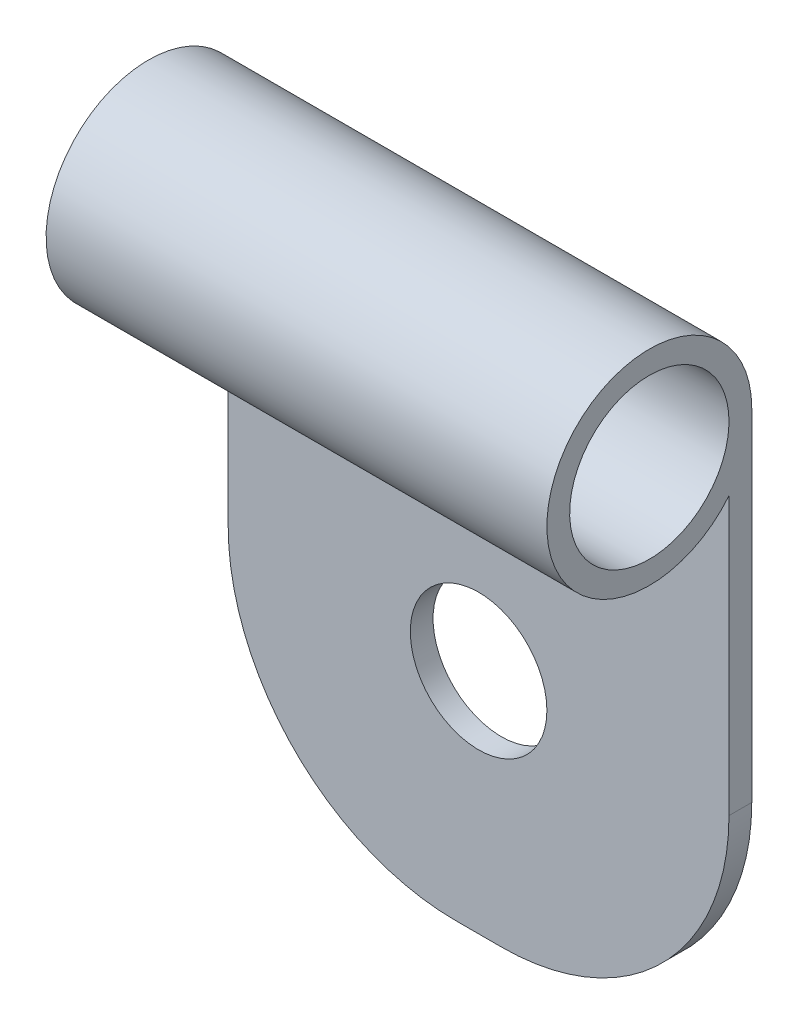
ISO-10303-21;
HEADER;
FILE_DESCRIPTION(('STEP AP214'),'2;1');
FILE_NAME('part.step','',(''),(''),'','','');
FILE_SCHEMA(('AUTOMOTIVE_DESIGN { 1 0 10303 214 1 1 1 1 }'));
ENDSEC;
DATA;
#1=APPLICATION_CONTEXT('core data for automotive mechanical design processes');
#2=APPLICATION_PROTOCOL_DEFINITION('international standard','automotive_design',2000,#1);
#3=PRODUCT_CONTEXT('',#1,'mechanical');
#4=PRODUCT('Part','Part','',(#3));
#5=PRODUCT_RELATED_PRODUCT_CATEGORY('part','',(#4));
#6=PRODUCT_DEFINITION_FORMATION('','',#4);
#7=PRODUCT_DEFINITION_CONTEXT('part definition',#1,'design');
#8=PRODUCT_DEFINITION('design','',#6,#7);
#9=PRODUCT_DEFINITION_SHAPE('','',#8);
#10=(LENGTH_UNIT() NAMED_UNIT(*) SI_UNIT(.MILLI.,.METRE.));
#11=(NAMED_UNIT(*) PLANE_ANGLE_UNIT() SI_UNIT($,.RADIAN.));
#12=(NAMED_UNIT(*) SI_UNIT($,.STERADIAN.) SOLID_ANGLE_UNIT());
#13=UNCERTAINTY_MEASURE_WITH_UNIT(LENGTH_MEASURE(1.E-05),#10,'distance_accuracy_value','');
#14=(GEOMETRIC_REPRESENTATION_CONTEXT(3) GLOBAL_UNCERTAINTY_ASSIGNED_CONTEXT((#13)) GLOBAL_UNIT_ASSIGNED_CONTEXT((#10,
#11,#12)) REPRESENTATION_CONTEXT('',''));
#15=CARTESIAN_POINT('',(0.,0.,0.));
#16=DIRECTION('',(0.,0.,1.));
#17=DIRECTION('',(1.,0.,0.));
#18=AXIS2_PLACEMENT_3D('',#15,#16,#17);
#19=CARTESIAN_POINT('',(-1.,0.,1.));
#20=DIRECTION('',(0.,0.,-1.));
#21=DIRECTION('',(-1.,0.,0.));
#22=AXIS2_PLACEMENT_3D('',#19,#20,#21);
#23=PLANE('',#22);
#24=DIRECTION('',(0.,1.,0.));
#25=VECTOR('',#24,1.);
#26=CARTESIAN_POINT('',(11.,15.,1.));
#27=LINE('',#26,#25);
#28=CARTESIAN_POINT('',(11.,0.,1.));
#29=VERTEX_POINT('',#28);
#30=CARTESIAN_POINT('',(11.,12.1715728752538,1.));
#31=VERTEX_POINT('',#30);
#32=EDGE_CURVE('E52',#29,#31,#27,.T.);
#33=ORIENTED_EDGE('',*,*,#32,.T.);
#34=DIRECTION('',(1.,0.,0.));
#35=VECTOR('',#34,1.);
#36=CARTESIAN_POINT('',(-11.,12.1715728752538,1.));
#37=LINE('',#36,#35);
#38=CARTESIAN_POINT('',(-11.,12.1715728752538,1.));
#39=VERTEX_POINT('',#38);
#40=EDGE_CURVE('E47',#31,#39,#37,.F.);
#41=ORIENTED_EDGE('',*,*,#40,.T.);
#42=DIRECTION('',(0.,-1.,0.));
#43=VECTOR('',#42,1.);
#44=CARTESIAN_POINT('',(-11.,15.,1.));
#45=LINE('',#44,#43);
#46=CARTESIAN_POINT('',(-11.,0.,1.));
#47=VERTEX_POINT('',#46);
#48=EDGE_CURVE('E104',#39,#47,#45,.T.);
#49=ORIENTED_EDGE('',*,*,#48,.T.);
#50=CARTESIAN_POINT('',(-1.,0.,1.));
#51=DIRECTION('',(0.,0.,1.));
#52=DIRECTION('',(-1.,0.,0.));
#53=AXIS2_PLACEMENT_3D('',#50,#51,#52);
#54=CIRCLE('',#53,10.);
#55=CARTESIAN_POINT('',(-1.,-10.,1.));
#56=VERTEX_POINT('',#55);
#57=EDGE_CURVE('E124',#47,#56,#54,.T.);
#58=ORIENTED_EDGE('',*,*,#57,.T.);
#59=DIRECTION('',(1.,0.,0.));
#60=VECTOR('',#59,1.);
#61=CARTESIAN_POINT('',(-1.,-10.,1.));
#62=LINE('',#61,#60);
#63=CARTESIAN_POINT('',(1.,-10.,1.));
#64=VERTEX_POINT('',#63);
#65=EDGE_CURVE('E126',#56,#64,#62,.T.);
#66=ORIENTED_EDGE('',*,*,#65,.T.);
#67=CARTESIAN_POINT('',(1.,0.,1.));
#68=DIRECTION('',(0.,0.,1.));
#69=DIRECTION('',(1.,0.,0.));
#70=AXIS2_PLACEMENT_3D('',#67,#68,#69);
#71=CIRCLE('',#70,10.);
#72=EDGE_CURVE('E128',#64,#29,#71,.T.);
#73=ORIENTED_EDGE('',*,*,#72,.T.);
#74=EDGE_LOOP('',(#33,#41,#49,#58,#66,#73));
#75=FACE_BOUND('',#74,.T.);
#76=CARTESIAN_POINT('',(0.,0.,1.));
#77=DIRECTION('',(0.,0.,1.));
#78=DIRECTION('',(1.,0.,0.));
#79=AXIS2_PLACEMENT_3D('',#76,#77,#78);
#80=CIRCLE('',#79,3.);
#81=CARTESIAN_POINT('',(3.,0.,1.));
#82=VERTEX_POINT('',#81);
#83=EDGE_CURVE('E95',#82,#82,#80,.T.);
#84=ORIENTED_EDGE('',*,*,#83,.F.);
#85=EDGE_LOOP('',(#84));
#86=FACE_BOUND('',#85,.T.);
#87=ADVANCED_FACE('F32',(#75,#86),#23,.F.);
#88=CARTESIAN_POINT('',(-1.,0.,0.));
#89=DIRECTION('',(0.,0.,-1.));
#90=DIRECTION('',(-1.,0.,0.));
#91=AXIS2_PLACEMENT_3D('',#88,#89,#90);
#92=PLANE('',#91);
#93=DIRECTION('',(-1.,0.,0.));
#94=VECTOR('',#93,1.);
#95=CARTESIAN_POINT('',(11.,15.,0.));
#96=LINE('',#95,#94);
#97=CARTESIAN_POINT('',(11.,15.,0.));
#98=VERTEX_POINT('',#97);
#99=CARTESIAN_POINT('',(-11.,15.,0.));
#100=VERTEX_POINT('',#99);
#101=EDGE_CURVE('E83',#98,#100,#96,.T.);
#102=ORIENTED_EDGE('',*,*,#101,.F.);
#103=DIRECTION('',(0.,1.,0.));
#104=VECTOR('',#103,1.);
#105=CARTESIAN_POINT('',(11.,15.,0.));
#106=LINE('',#105,#104);
#107=CARTESIAN_POINT('',(11.,0.,0.));
#108=VERTEX_POINT('',#107);
#109=EDGE_CURVE('E88',#108,#98,#106,.T.);
#110=ORIENTED_EDGE('',*,*,#109,.F.);
#111=CARTESIAN_POINT('',(1.,0.,0.));
#112=DIRECTION('',(0.,0.,1.));
#113=DIRECTION('',(1.,0.,0.));
#114=AXIS2_PLACEMENT_3D('',#111,#112,#113);
#115=CIRCLE('',#114,10.);
#116=CARTESIAN_POINT('',(1.,-10.,0.));
#117=VERTEX_POINT('',#116);
#118=EDGE_CURVE('E105',#117,#108,#115,.T.);
#119=ORIENTED_EDGE('',*,*,#118,.F.);
#120=DIRECTION('',(1.,0.,0.));
#121=VECTOR('',#120,1.);
#122=CARTESIAN_POINT('',(-1.,-10.,0.));
#123=LINE('',#122,#121);
#124=CARTESIAN_POINT('',(-1.,-10.,0.));
#125=VERTEX_POINT('',#124);
#126=EDGE_CURVE('E134',#125,#117,#123,.T.);
#127=ORIENTED_EDGE('',*,*,#126,.F.);
#128=CARTESIAN_POINT('',(-1.,0.,0.));
#129=DIRECTION('',(0.,0.,1.));
#130=DIRECTION('',(-1.,0.,0.));
#131=AXIS2_PLACEMENT_3D('',#128,#129,#130);
#132=CIRCLE('',#131,10.);
#133=CARTESIAN_POINT('',(-11.,0.,0.));
#134=VERTEX_POINT('',#133);
#135=EDGE_CURVE('E132',#134,#125,#132,.T.);
#136=ORIENTED_EDGE('',*,*,#135,.F.);
#137=DIRECTION('',(0.,-1.,0.));
#138=VECTOR('',#137,1.);
#139=CARTESIAN_POINT('',(-11.,15.,0.));
#140=LINE('',#139,#138);
#141=EDGE_CURVE('E90',#100,#134,#140,.T.);
#142=ORIENTED_EDGE('',*,*,#141,.F.);
#143=EDGE_LOOP('',(#102,#110,#119,#127,#136,#142));
#144=FACE_BOUND('',#143,.T.);
#145=CARTESIAN_POINT('',(0.,0.,0.));
#146=DIRECTION('',(0.,0.,1.));
#147=DIRECTION('',(1.,0.,0.));
#148=AXIS2_PLACEMENT_3D('',#145,#146,#147);
#149=CIRCLE('',#148,3.);
#150=CARTESIAN_POINT('',(3.,0.,0.));
#151=VERTEX_POINT('',#150);
#152=EDGE_CURVE('E118',#151,#151,#149,.T.);
#153=ORIENTED_EDGE('',*,*,#152,.T.);
#154=EDGE_LOOP('',(#153));
#155=FACE_BOUND('',#154,.T.);
#156=ADVANCED_FACE('F85',(#144,#155),#92,.T.);
#157=CARTESIAN_POINT('',(-11.,15.,1.));
#158=DIRECTION('',(1.,0.,0.));
#159=DIRECTION('',(0.,1.,0.));
#160=AXIS2_PLACEMENT_3D('',#157,#158,#159);
#161=PLANE('',#160);
#162=ORIENTED_EDGE('',*,*,#48,.F.);
#163=CARTESIAN_POINT('',(-11.,15.,4.5));
#164=DIRECTION('',(1.,0.,0.));
#165=DIRECTION('',(0.,1.,0.));
#166=AXIS2_PLACEMENT_3D('',#163,#164,#165);
#167=CIRCLE('',#166,4.5);
#168=EDGE_CURVE('E108',#100,#39,#167,.T.);
#169=ORIENTED_EDGE('',*,*,#168,.F.);
#170=ORIENTED_EDGE('',*,*,#141,.T.);
#171=DIRECTION('',(0.,0.,-1.));
#172=VECTOR('',#171,1.);
#173=CARTESIAN_POINT('',(-11.,0.,1.));
#174=LINE('',#173,#172);
#175=EDGE_CURVE('E11',#47,#134,#174,.T.);
#176=ORIENTED_EDGE('',*,*,#175,.F.);
#177=EDGE_LOOP('',(#162,#169,#170,#176));
#178=FACE_BOUND('',#177,.T.);
#179=CARTESIAN_POINT('',(-11.,15.,4.5));
#180=DIRECTION('',(1.,0.,0.));
#181=DIRECTION('',(0.,1.,0.));
#182=AXIS2_PLACEMENT_3D('',#179,#180,#181);
#183=CIRCLE('',#182,3.5);
#184=CARTESIAN_POINT('',(-11.,18.5,4.5));
#185=VERTEX_POINT('',#184);
#186=EDGE_CURVE('E109',#185,#185,#183,.T.);
#187=ORIENTED_EDGE('',*,*,#186,.T.);
#188=EDGE_LOOP('',(#187));
#189=FACE_BOUND('',#188,.T.);
#190=ADVANCED_FACE('F34',(#178,#189),#161,.F.);
#191=CARTESIAN_POINT('',(-1.,0.,1.));
#192=DIRECTION('',(0.,0.,-1.));
#193=DIRECTION('',(-1.,0.,0.));
#194=AXIS2_PLACEMENT_3D('',#191,#192,#193);
#195=CYLINDRICAL_SURFACE('',#194,10.);
#196=ORIENTED_EDGE('',*,*,#135,.T.);
#197=DIRECTION('',(0.,0.,-1.));
#198=VECTOR('',#197,1.);
#199=CARTESIAN_POINT('',(-1.,-10.,1.));
#200=LINE('',#199,#198);
#201=EDGE_CURVE('E40',#56,#125,#200,.T.);
#202=ORIENTED_EDGE('',*,*,#201,.F.);
#203=ORIENTED_EDGE('',*,*,#57,.F.);
#204=ORIENTED_EDGE('',*,*,#175,.T.);
#205=EDGE_LOOP('',(#196,#202,#203,#204));
#206=FACE_BOUND('',#205,.T.);
#207=ADVANCED_FACE('F154',(#206),#195,.T.);
#208=CARTESIAN_POINT('',(-1.,-10.,1.));
#209=DIRECTION('',(0.,1.,0.));
#210=DIRECTION('',(0.,0.,1.));
#211=AXIS2_PLACEMENT_3D('',#208,#209,#210);
#212=PLANE('',#211);
#213=ORIENTED_EDGE('',*,*,#126,.T.);
#214=DIRECTION('',(0.,0.,-1.));
#215=VECTOR('',#214,1.);
#216=CARTESIAN_POINT('',(1.,-10.,1.));
#217=LINE('',#216,#215);
#218=EDGE_CURVE('E138',#64,#117,#217,.T.);
#219=ORIENTED_EDGE('',*,*,#218,.F.);
#220=ORIENTED_EDGE('',*,*,#65,.F.);
#221=ORIENTED_EDGE('',*,*,#201,.T.);
#222=EDGE_LOOP('',(#213,#219,#220,#221));
#223=FACE_BOUND('',#222,.T.);
#224=ADVANCED_FACE('F145',(#223),#212,.F.);
#225=CARTESIAN_POINT('',(1.,0.,1.));
#226=DIRECTION('',(0.,0.,-1.));
#227=DIRECTION('',(-1.,0.,0.));
#228=AXIS2_PLACEMENT_3D('',#225,#226,#227);
#229=CYLINDRICAL_SURFACE('',#228,10.);
#230=ORIENTED_EDGE('',*,*,#118,.T.);
#231=DIRECTION('',(0.,0.,-1.));
#232=VECTOR('',#231,1.);
#233=CARTESIAN_POINT('',(11.,0.,1.));
#234=LINE('',#233,#232);
#235=EDGE_CURVE('E103',#29,#108,#234,.T.);
#236=ORIENTED_EDGE('',*,*,#235,.F.);
#237=ORIENTED_EDGE('',*,*,#72,.F.);
#238=ORIENTED_EDGE('',*,*,#218,.T.);
#239=EDGE_LOOP('',(#230,#236,#237,#238));
#240=FACE_BOUND('',#239,.T.);
#241=ADVANCED_FACE('F150',(#240),#229,.T.);
#242=CARTESIAN_POINT('',(11.,15.,1.));
#243=DIRECTION('',(-1.,0.,0.));
#244=DIRECTION('',(0.,-1.,0.));
#245=AXIS2_PLACEMENT_3D('',#242,#243,#244);
#246=PLANE('',#245);
#247=CARTESIAN_POINT('',(11.,15.,4.5));
#248=DIRECTION('',(1.,0.,0.));
#249=DIRECTION('',(0.,1.,0.));
#250=AXIS2_PLACEMENT_3D('',#247,#248,#249);
#251=CIRCLE('',#250,3.5);
#252=CARTESIAN_POINT('',(11.,18.5,4.5));
#253=VERTEX_POINT('',#252);
#254=EDGE_CURVE('E113',#253,#253,#251,.T.);
#255=ORIENTED_EDGE('',*,*,#254,.F.);
#256=EDGE_LOOP('',(#255));
#257=FACE_BOUND('',#256,.T.);
#258=ORIENTED_EDGE('',*,*,#109,.T.);
#259=CARTESIAN_POINT('',(11.,15.,4.5));
#260=DIRECTION('',(1.,0.,0.));
#261=DIRECTION('',(0.,1.,0.));
#262=AXIS2_PLACEMENT_3D('',#259,#260,#261);
#263=CIRCLE('',#262,4.5);
#264=EDGE_CURVE('E101',#98,#31,#263,.T.);
#265=ORIENTED_EDGE('',*,*,#264,.T.);
#266=ORIENTED_EDGE('',*,*,#32,.F.);
#267=ORIENTED_EDGE('',*,*,#235,.T.);
#268=EDGE_LOOP('',(#258,#265,#266,#267));
#269=FACE_BOUND('',#268,.T.);
#270=ADVANCED_FACE('F100',(#257,#269),#246,.F.);
#271=CARTESIAN_POINT('',(0.,0.,1.));
#272=DIRECTION('',(0.,0.,-1.));
#273=DIRECTION('',(-1.,0.,0.));
#274=AXIS2_PLACEMENT_3D('',#271,#272,#273);
#275=CYLINDRICAL_SURFACE('',#274,3.);
#276=ORIENTED_EDGE('',*,*,#83,.T.);
#277=EDGE_LOOP('',(#276));
#278=FACE_BOUND('',#277,.T.);
#279=ORIENTED_EDGE('',*,*,#152,.F.);
#280=EDGE_LOOP('',(#279));
#281=FACE_BOUND('',#280,.T.);
#282=ADVANCED_FACE('F167',(#278,#281),#275,.F.);
#283=CARTESIAN_POINT('',(-11.,15.,4.5));
#284=DIRECTION('',(1.,0.,0.));
#285=DIRECTION('',(0.,1.,0.));
#286=AXIS2_PLACEMENT_3D('',#283,#284,#285);
#287=CYLINDRICAL_SURFACE('',#286,4.5);
#288=ORIENTED_EDGE('',*,*,#40,.F.);
#289=ORIENTED_EDGE('',*,*,#264,.F.);
#290=ORIENTED_EDGE('',*,*,#101,.T.);
#291=ORIENTED_EDGE('',*,*,#168,.T.);
#292=EDGE_LOOP('',(#288,#289,#290,#291));
#293=FACE_BOUND('',#292,.T.);
#294=ADVANCED_FACE('F107',(#293),#287,.T.);
#295=CARTESIAN_POINT('',(-11.,15.,4.5));
#296=DIRECTION('',(1.,0.,0.));
#297=DIRECTION('',(0.,1.,0.));
#298=AXIS2_PLACEMENT_3D('',#295,#296,#297);
#299=CYLINDRICAL_SURFACE('',#298,3.5);
#300=ORIENTED_EDGE('',*,*,#254,.T.);
#301=EDGE_LOOP('',(#300));
#302=FACE_BOUND('',#301,.T.);
#303=ORIENTED_EDGE('',*,*,#186,.F.);
#304=EDGE_LOOP('',(#303));
#305=FACE_BOUND('',#304,.T.);
#306=ADVANCED_FACE('F160',(#302,#305),#299,.F.);
#307=CLOSED_SHELL('',(#87,#156,#190,#207,#224,#241,#270,#282,#294,#306));
#308=MANIFOLD_SOLID_BREP('B2',#307);
#309=ADVANCED_BREP_SHAPE_REPRESENTATION('',(#18,#308),#14);
#310=SHAPE_DEFINITION_REPRESENTATION(#9,#309);
ENDSEC;
END-ISO-10303-21;
